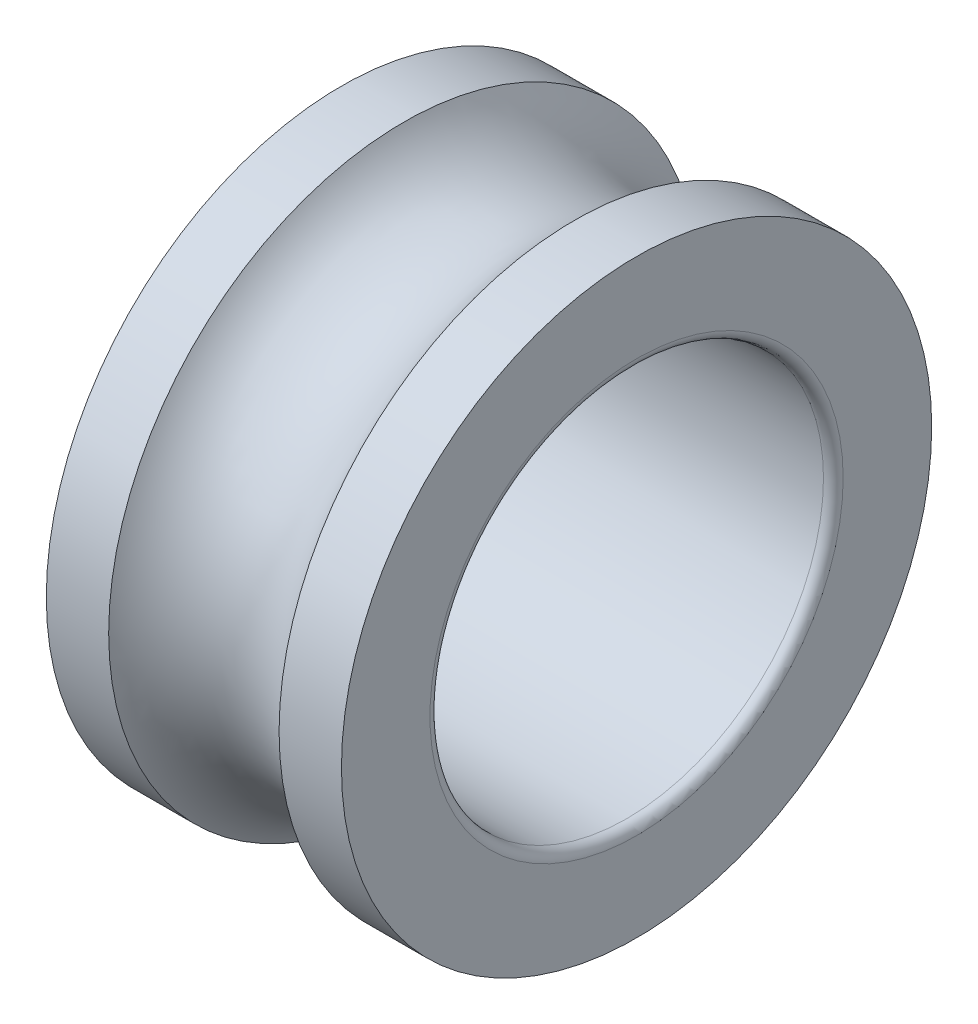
from build123d import *

# Parameters (mm, degrees)
CONG_1_R = 0.2


with BuildPart() as part:
    # Esquisse1 → Base-R_volution (revolve)
    with BuildSketch(Plane.XY, mode=Mode.PRIVATE) as base_r_volution_sk:
        with BuildLine():
            Line((-3, 4), (3, 4))
            Line((3, 4), (3, 6))
            Line((3, 6), (1.732050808, 6))
            ThreePointArc((1.732050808, 6), (0, 5), (-1.732050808, 6))
            Line((-1.732050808, 6), (-3, 6))
            Line((-3, 6), (-3, 4))
        make_face()
    revolve(base_r_volution_sk.sketch.rotate(Axis((-8.45016699, 0, 0), (1, 0, 0)), 90), axis=Axis((-8.45016699, 0, 0), (1, 0, 0)))

    # Cong_1
    cong_1_edges = [part.edges().sort_by_distance(p)[0] for p in [
        (-3, 0, -4),
        (3, 0, -4),
    ]]
    fillet(cong_1_edges, radius=CONG_1_R)


solid = part.part
